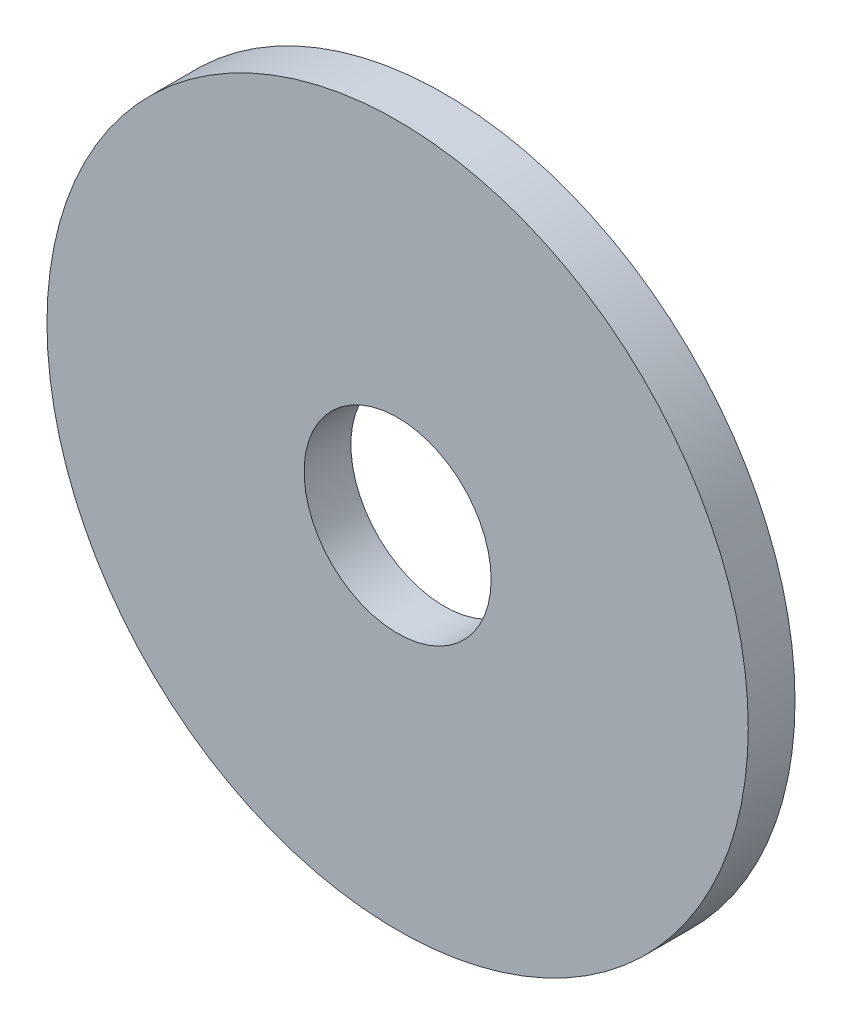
ISO-10303-21;
HEADER;
FILE_DESCRIPTION(('STEP AP214'),'2;1');
FILE_NAME('part.step','',(''),(''),'','','');
FILE_SCHEMA(('AUTOMOTIVE_DESIGN { 1 0 10303 214 1 1 1 1 }'));
ENDSEC;
DATA;
#1=APPLICATION_CONTEXT('core data for automotive mechanical design processes');
#2=APPLICATION_PROTOCOL_DEFINITION('international standard','automotive_design',2000,#1);
#3=PRODUCT_CONTEXT('',#1,'mechanical');
#4=PRODUCT('Part','Part','',(#3));
#5=PRODUCT_RELATED_PRODUCT_CATEGORY('part','',(#4));
#6=PRODUCT_DEFINITION_FORMATION('','',#4);
#7=PRODUCT_DEFINITION_CONTEXT('part definition',#1,'design');
#8=PRODUCT_DEFINITION('design','',#6,#7);
#9=PRODUCT_DEFINITION_SHAPE('','',#8);
#10=(LENGTH_UNIT() NAMED_UNIT(*) SI_UNIT(.MILLI.,.METRE.));
#11=(NAMED_UNIT(*) PLANE_ANGLE_UNIT() SI_UNIT($,.RADIAN.));
#12=(NAMED_UNIT(*) SI_UNIT($,.STERADIAN.) SOLID_ANGLE_UNIT());
#13=UNCERTAINTY_MEASURE_WITH_UNIT(LENGTH_MEASURE(1.E-05),#10,'distance_accuracy_value','');
#14=(GEOMETRIC_REPRESENTATION_CONTEXT(3) GLOBAL_UNCERTAINTY_ASSIGNED_CONTEXT((#13)) GLOBAL_UNIT_ASSIGNED_CONTEXT((#10,
#11,#12)) REPRESENTATION_CONTEXT('',''));
#15=CARTESIAN_POINT('',(0.,0.,0.));
#16=DIRECTION('',(0.,0.,1.));
#17=DIRECTION('',(1.,0.,0.));
#18=AXIS2_PLACEMENT_3D('',#15,#16,#17);
#19=CARTESIAN_POINT('',(0.,0.,0.8));
#20=DIRECTION('',(0.,0.,1.));
#21=DIRECTION('',(1.,0.,0.));
#22=AXIS2_PLACEMENT_3D('',#19,#20,#21);
#23=PLANE('',#22);
#24=CARTESIAN_POINT('',(0.,0.,0.8));
#25=DIRECTION('',(0.,0.,1.));
#26=DIRECTION('',(1.,0.,0.));
#27=AXIS2_PLACEMENT_3D('',#24,#25,#26);
#28=CIRCLE('',#27,6.);
#29=CARTESIAN_POINT('',(6.,0.,0.8));
#30=VERTEX_POINT('',#29);
#31=EDGE_CURVE('E10',#30,#30,#28,.T.);
#32=ORIENTED_EDGE('',*,*,#31,.T.);
#33=EDGE_LOOP('',(#32));
#34=FACE_BOUND('',#33,.T.);
#35=CARTESIAN_POINT('',(0.,0.,0.8));
#36=DIRECTION('',(0.,0.,1.));
#37=DIRECTION('',(1.,0.,0.));
#38=AXIS2_PLACEMENT_3D('',#35,#36,#37);
#39=CIRCLE('',#38,1.6);
#40=CARTESIAN_POINT('',(1.6,0.,0.8));
#41=VERTEX_POINT('',#40);
#42=EDGE_CURVE('E41',#41,#41,#39,.T.);
#43=ORIENTED_EDGE('',*,*,#42,.F.);
#44=EDGE_LOOP('',(#43));
#45=FACE_BOUND('',#44,.T.);
#46=ADVANCED_FACE('F30',(#34,#45),#23,.T.);
#47=CARTESIAN_POINT('',(0.,0.,0.));
#48=DIRECTION('',(0.,0.,1.));
#49=DIRECTION('',(1.,0.,0.));
#50=AXIS2_PLACEMENT_3D('',#47,#48,#49);
#51=PLANE('',#50);
#52=CARTESIAN_POINT('',(0.,0.,0.));
#53=DIRECTION('',(0.,0.,1.));
#54=DIRECTION('',(1.,0.,0.));
#55=AXIS2_PLACEMENT_3D('',#52,#53,#54);
#56=CIRCLE('',#55,6.);
#57=CARTESIAN_POINT('',(6.,0.,0.));
#58=VERTEX_POINT('',#57);
#59=EDGE_CURVE('E37',#58,#58,#56,.T.);
#60=ORIENTED_EDGE('',*,*,#59,.F.);
#61=EDGE_LOOP('',(#60));
#62=FACE_BOUND('',#61,.T.);
#63=CARTESIAN_POINT('',(0.,0.,0.));
#64=DIRECTION('',(0.,0.,1.));
#65=DIRECTION('',(1.,0.,0.));
#66=AXIS2_PLACEMENT_3D('',#63,#64,#65);
#67=CIRCLE('',#66,1.6);
#68=CARTESIAN_POINT('',(1.6,0.,0.));
#69=VERTEX_POINT('',#68);
#70=EDGE_CURVE('E45',#69,#69,#67,.T.);
#71=ORIENTED_EDGE('',*,*,#70,.T.);
#72=EDGE_LOOP('',(#71));
#73=FACE_BOUND('',#72,.T.);
#74=ADVANCED_FACE('F51',(#62,#73),#51,.F.);
#75=CARTESIAN_POINT('',(0.,0.,0.8));
#76=DIRECTION('',(0.,0.,-1.));
#77=DIRECTION('',(-1.,0.,0.));
#78=AXIS2_PLACEMENT_3D('',#75,#76,#77);
#79=CYLINDRICAL_SURFACE('',#78,6.);
#80=ORIENTED_EDGE('',*,*,#31,.F.);
#81=EDGE_LOOP('',(#80));
#82=FACE_BOUND('',#81,.T.);
#83=ORIENTED_EDGE('',*,*,#59,.T.);
#84=EDGE_LOOP('',(#83));
#85=FACE_BOUND('',#84,.T.);
#86=ADVANCED_FACE('F32',(#82,#85),#79,.T.);
#87=CARTESIAN_POINT('',(0.,0.,0.8));
#88=DIRECTION('',(0.,0.,-1.));
#89=DIRECTION('',(-1.,0.,0.));
#90=AXIS2_PLACEMENT_3D('',#87,#88,#89);
#91=CYLINDRICAL_SURFACE('',#90,1.6);
#92=ORIENTED_EDGE('',*,*,#42,.T.);
#93=EDGE_LOOP('',(#92));
#94=FACE_BOUND('',#93,.T.);
#95=ORIENTED_EDGE('',*,*,#70,.F.);
#96=EDGE_LOOP('',(#95));
#97=FACE_BOUND('',#96,.T.);
#98=ADVANCED_FACE('F53',(#94,#97),#91,.F.);
#99=CLOSED_SHELL('',(#46,#74,#86,#98));
#100=MANIFOLD_SOLID_BREP('B2',#99);
#101=ADVANCED_BREP_SHAPE_REPRESENTATION('',(#18,#100),#14);
#102=SHAPE_DEFINITION_REPRESENTATION(#9,#101);
ENDSEC;
END-ISO-10303-21;
